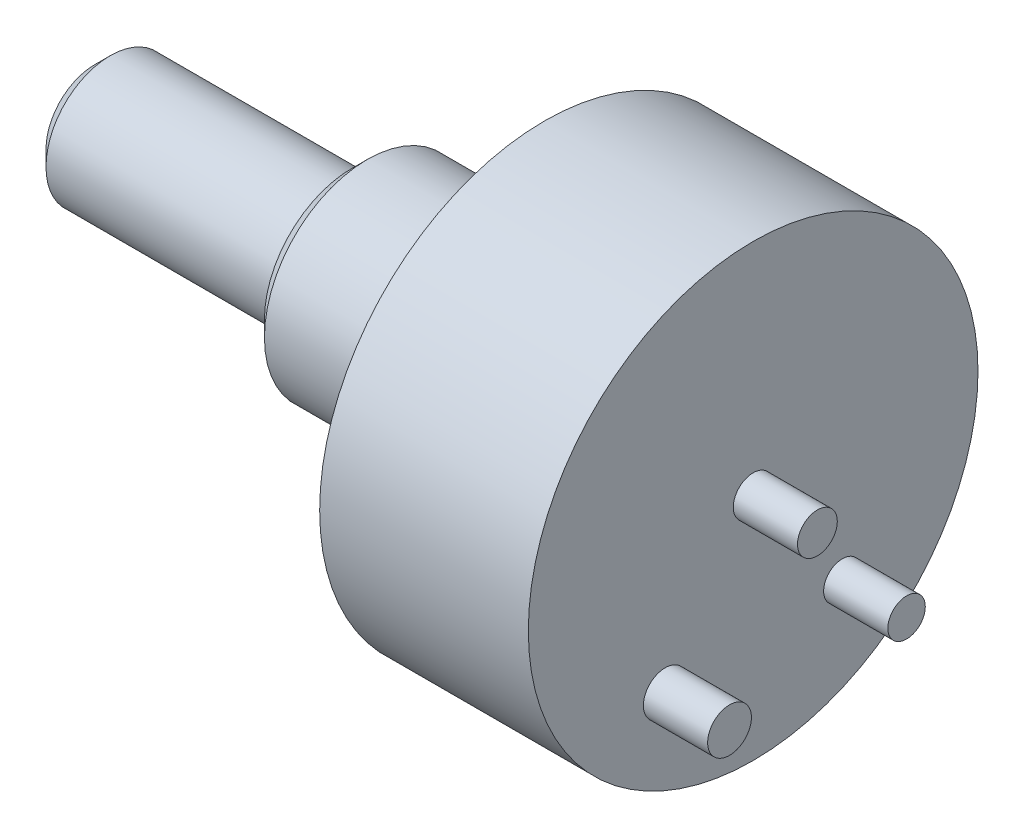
from build123d import *

# Parameters (mm, degrees)
CHAMFER1_SIZE  = 0.762
SKETCH2_R      = 0.984063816
SKETCH2_R_2    = 0.925051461
SKETCH2_R_3    = 1.081973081
EXTRUDE1_DEPTH = 3.175


with BuildPart() as part:
    # Sketch1 → Revolve1 (revolve)
    with BuildSketch(Plane.XY, mode=Mode.PRIVATE) as revolve1_sk:
        Polygon((0, 0), (0, 11.1125), (-10.3124, 11.1125), (-10.3124, 5.207), (-11.8364, 5.207), (-11.8364, 5.08), (-19.8374, 5.08), (-19.8374, 3.175), (-32.5374, 3.175), (-32.5374, 0), align=None)
    revolve(revolve1_sk.sketch.rotate(Axis((0, 0, 0), (-1, 0, 0)), 90), axis=Axis((0, 0, 0), (-1, 0, 0)))

    # Chamfer1
    chamfer1_edges = [part.edges().sort_by_distance(p)[0] for p in [
        (-32.5374, 0, 3.175),
        (-19.8374, 0, 5.08),
    ]]
    chamfer(chamfer1_edges, length=CHAMFER1_SIZE)

    # Sketch2 → Extrude1 (add)
    with BuildSketch(Plane(origin=(0, 0, 0), x_dir=(0, 0, -1), z_dir=(1, 0, 0))):
        with Locations((0, 0.222759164)):
            Circle(SKETCH2_R)
        with Locations((4.40744917, -5.600801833)):
            Circle(SKETCH2_R_2)
        with Locations((-4.343803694, -6.04632016)):
            Circle(SKETCH2_R_3)
    extrude(amount=EXTRUDE1_DEPTH)


solid = part.part
